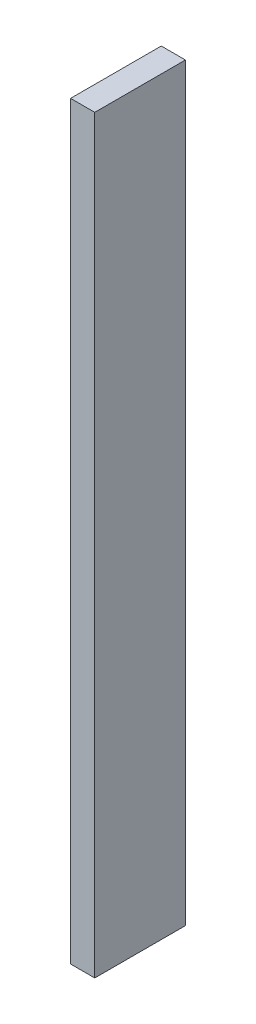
ISO-10303-21;
HEADER;
FILE_DESCRIPTION(('STEP AP214'),'2;1');
FILE_NAME('part.step','',(''),(''),'','','');
FILE_SCHEMA(('AUTOMOTIVE_DESIGN { 1 0 10303 214 1 1 1 1 }'));
ENDSEC;
DATA;
#1=APPLICATION_CONTEXT('core data for automotive mechanical design processes');
#2=APPLICATION_PROTOCOL_DEFINITION('international standard','automotive_design',2000,#1);
#3=PRODUCT_CONTEXT('',#1,'mechanical');
#4=PRODUCT('Part','Part','',(#3));
#5=PRODUCT_RELATED_PRODUCT_CATEGORY('part','',(#4));
#6=PRODUCT_DEFINITION_FORMATION('','',#4);
#7=PRODUCT_DEFINITION_CONTEXT('part definition',#1,'design');
#8=PRODUCT_DEFINITION('design','',#6,#7);
#9=PRODUCT_DEFINITION_SHAPE('','',#8);
#10=(LENGTH_UNIT() NAMED_UNIT(*) SI_UNIT(.MILLI.,.METRE.));
#11=(NAMED_UNIT(*) PLANE_ANGLE_UNIT() SI_UNIT($,.RADIAN.));
#12=(NAMED_UNIT(*) SI_UNIT($,.STERADIAN.) SOLID_ANGLE_UNIT());
#13=UNCERTAINTY_MEASURE_WITH_UNIT(LENGTH_MEASURE(1.E-05),#10,'distance_accuracy_value','');
#14=(GEOMETRIC_REPRESENTATION_CONTEXT(3) GLOBAL_UNCERTAINTY_ASSIGNED_CONTEXT((#13)) GLOBAL_UNIT_ASSIGNED_CONTEXT((#10,
#11,#12)) REPRESENTATION_CONTEXT('',''));
#15=CARTESIAN_POINT('',(0.,0.,0.));
#16=DIRECTION('',(0.,0.,1.));
#17=DIRECTION('',(1.,0.,0.));
#18=AXIS2_PLACEMENT_3D('',#15,#16,#17);
#19=CARTESIAN_POINT('',(-1.62196645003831E-13,62.,15.));
#20=DIRECTION('',(1.,0.,0.));
#21=DIRECTION('',(0.,0.,-1.));
#22=AXIS2_PLACEMENT_3D('',#19,#20,#21);
#23=PLANE('',#22);
#24=DIRECTION('',(0.,-1.,0.));
#25=VECTOR('',#24,1.);
#26=CARTESIAN_POINT('',(-1.62196645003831E-13,62.,15.));
#27=LINE('',#26,#25);
#28=CARTESIAN_POINT('',(2.70400021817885E-13,-62.,15.));
#29=VERTEX_POINT('',#28);
#30=CARTESIAN_POINT('',(-1.62630325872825E-13,62.,15.));
#31=VERTEX_POINT('',#30);
#32=EDGE_CURVE('E87',#29,#31,#27,.F.);
#33=ORIENTED_EDGE('',*,*,#32,.T.);
#34=DIRECTION('',(0.,0.,-1.));
#35=VECTOR('',#34,1.);
#36=CARTESIAN_POINT('',(-2.16189913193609E-13,62.,0.));
#37=LINE('',#36,#35);
#38=CARTESIAN_POINT('',(-2.1671523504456E-13,62.,0.));
#39=VERTEX_POINT('',#38);
#40=EDGE_CURVE('E10',#31,#39,#37,.T.);
#41=ORIENTED_EDGE('',*,*,#40,.T.);
#42=DIRECTION('',(0.,1.,0.));
#43=VECTOR('',#42,1.);
#44=CARTESIAN_POINT('',(2.17215991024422E-13,-62.2828427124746,0.));
#45=LINE('',#44,#43);
#46=CARTESIAN_POINT('',(-1.67834496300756E-13,48.,0.));
#47=VERTEX_POINT('',#46);
#48=EDGE_CURVE('E108',#47,#39,#45,.T.);
#49=ORIENTED_EDGE('',*,*,#48,.F.);
#50=DIRECTION('',(0.,0.,-1.));
#51=VECTOR('',#50,1.);
#52=CARTESIAN_POINT('',(-1.13190706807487E-13,48.,15.));
#53=LINE('',#52,#51);
#54=CARTESIAN_POINT('',(-1.46150452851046E-13,48.,6.));
#55=VERTEX_POINT('',#54);
#56=EDGE_CURVE('E112',#55,#47,#53,.T.);
#57=ORIENTED_EDGE('',*,*,#56,.F.);
#58=DIRECTION('',(0.,1.,0.));
#59=VECTOR('',#58,1.);
#60=CARTESIAN_POINT('',(-1.94505869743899E-13,62.,6.));
#61=LINE('',#60,#59);
#62=CARTESIAN_POINT('',(1.89301699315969E-13,-48.,6.));
#63=VERTEX_POINT('',#62);
#64=EDGE_CURVE('E114',#63,#55,#61,.T.);
#65=ORIENTED_EDGE('',*,*,#64,.F.);
#66=DIRECTION('',(0.,0.,-1.));
#67=VECTOR('',#66,1.);
#68=CARTESIAN_POINT('',(2.22044604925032E-13,-48.,15.));
#69=LINE('',#68,#67);
#70=CARTESIAN_POINT('',(1.67400815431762E-13,-48.,0.));
#71=VERTEX_POINT('',#70);
#72=EDGE_CURVE('E117',#71,#63,#69,.F.);
#73=ORIENTED_EDGE('',*,*,#72,.F.);
#74=CARTESIAN_POINT('',(-2.16715234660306E-13,-62.,0.));
#75=VERTEX_POINT('',#74);
#76=EDGE_CURVE('E109',#75,#71,#45,.T.);
#77=ORIENTED_EDGE('',*,*,#76,.F.);
#78=DIRECTION('',(0.,0.,-1.));
#79=VECTOR('',#78,1.);
#80=CARTESIAN_POINT('',(2.16840434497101E-13,-62.,0.));
#81=LINE('',#80,#79);
#82=EDGE_CURVE('E83',#29,#75,#81,.T.);
#83=ORIENTED_EDGE('',*,*,#82,.F.);
#84=EDGE_LOOP('',(#33,#41,#49,#57,#65,#73,#77,#83));
#85=FACE_BOUND('',#84,.T.);
#86=ADVANCED_FACE('F16',(#85),#23,.F.);
#87=CARTESIAN_POINT('',(3.89999999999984,62.,15.));
#88=DIRECTION('',(0.,0.,-1.));
#89=DIRECTION('',(-1.,0.,0.));
#90=AXIS2_PLACEMENT_3D('',#87,#88,#89);
#91=PLANE('',#90);
#92=DIRECTION('',(-1.,0.,0.));
#93=VECTOR('',#92,1.);
#94=CARTESIAN_POINT('',(3.90000000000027,-62.,15.));
#95=LINE('',#94,#93);
#96=CARTESIAN_POINT('',(4.00000000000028,-62.,15.));
#97=VERTEX_POINT('',#96);
#98=EDGE_CURVE('E38',#97,#29,#95,.T.);
#99=ORIENTED_EDGE('',*,*,#98,.F.);
#100=DIRECTION('',(0.,-1.,0.));
#101=VECTOR('',#100,1.);
#102=CARTESIAN_POINT('',(3.99999999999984,62.,15.));
#103=LINE('',#102,#101);
#104=CARTESIAN_POINT('',(3.99999999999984,62.,15.));
#105=VERTEX_POINT('',#104);
#106=EDGE_CURVE('E103',#105,#97,#103,.T.);
#107=ORIENTED_EDGE('',*,*,#106,.F.);
#108=DIRECTION('',(-1.,0.,0.));
#109=VECTOR('',#108,1.);
#110=CARTESIAN_POINT('',(3.89999999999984,62.,15.));
#111=LINE('',#110,#109);
#112=EDGE_CURVE('E24',#105,#31,#111,.T.);
#113=ORIENTED_EDGE('',*,*,#112,.T.);
#114=ORIENTED_EDGE('',*,*,#32,.F.);
#115=EDGE_LOOP('',(#99,#107,#113,#114));
#116=FACE_BOUND('',#115,.T.);
#117=ADVANCED_FACE('F18',(#116),#91,.F.);
#118=CARTESIAN_POINT('',(3.89999999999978,62.,0.));
#119=DIRECTION('',(0.,1.,0.));
#120=DIRECTION('',(-1.,0.,0.));
#121=AXIS2_PLACEMENT_3D('',#118,#119,#120);
#122=PLANE('',#121);
#123=DIRECTION('',(1.,0.,0.));
#124=VECTOR('',#123,1.);
#125=CARTESIAN_POINT('',(3.89999999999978,62.,0.));
#126=LINE('',#125,#124);
#127=CARTESIAN_POINT('',(3.99999999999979,62.,0.));
#128=VERTEX_POINT('',#127);
#129=EDGE_CURVE('E95',#39,#128,#126,.T.);
#130=ORIENTED_EDGE('',*,*,#129,.F.);
#131=ORIENTED_EDGE('',*,*,#40,.F.);
#132=ORIENTED_EDGE('',*,*,#112,.F.);
#133=DIRECTION('',(0.,0.,1.));
#134=VECTOR('',#133,1.);
#135=CARTESIAN_POINT('',(3.99999999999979,62.,0.));
#136=LINE('',#135,#134);
#137=EDGE_CURVE('E99',#128,#105,#136,.T.);
#138=ORIENTED_EDGE('',*,*,#137,.F.);
#139=EDGE_LOOP('',(#130,#131,#132,#138));
#140=FACE_BOUND('',#139,.T.);
#141=ADVANCED_FACE('F146',(#140),#122,.T.);
#142=CARTESIAN_POINT('',(3.90000000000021,-62.,0.));
#143=DIRECTION('',(0.,1.,0.));
#144=DIRECTION('',(-1.,0.,0.));
#145=AXIS2_PLACEMENT_3D('',#142,#143,#144);
#146=PLANE('',#145);
#147=ORIENTED_EDGE('',*,*,#82,.T.);
#148=DIRECTION('',(1.,0.,0.));
#149=VECTOR('',#148,1.);
#150=CARTESIAN_POINT('',(3.90000000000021,-62.,0.));
#151=LINE('',#150,#149);
#152=CARTESIAN_POINT('',(4.00000000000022,-62.,0.));
#153=VERTEX_POINT('',#152);
#154=EDGE_CURVE('E78',#75,#153,#151,.T.);
#155=ORIENTED_EDGE('',*,*,#154,.T.);
#156=DIRECTION('',(0.,0.,-1.));
#157=VECTOR('',#156,1.);
#158=CARTESIAN_POINT('',(4.00000000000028,-62.,15.));
#159=LINE('',#158,#157);
#160=EDGE_CURVE('E82',#97,#153,#159,.T.);
#161=ORIENTED_EDGE('',*,*,#160,.F.);
#162=ORIENTED_EDGE('',*,*,#98,.T.);
#163=EDGE_LOOP('',(#147,#155,#161,#162));
#164=FACE_BOUND('',#163,.T.);
#165=ADVANCED_FACE('F80',(#164),#146,.F.);
#166=CARTESIAN_POINT('',(-6.,0.,7.5));
#167=DIRECTION('',(-1.,0.,0.));
#168=DIRECTION('',(0.,0.,1.));
#169=AXIS2_PLACEMENT_3D('',#166,#167,#168);
#170=PLANE('',#169);
#171=DIRECTION('',(0.,0.,1.));
#172=VECTOR('',#171,1.);
#173=CARTESIAN_POINT('',(-5.99999999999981,-48.,6.));
#174=LINE('',#173,#172);
#175=CARTESIAN_POINT('',(-5.99999999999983,-48.,0.));
#176=VERTEX_POINT('',#175);
#177=CARTESIAN_POINT('',(-5.99999999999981,-48.,6.));
#178=VERTEX_POINT('',#177);
#179=EDGE_CURVE('E134',#176,#178,#174,.T.);
#180=ORIENTED_EDGE('',*,*,#179,.T.);
#181=DIRECTION('',(0.,1.,0.));
#182=VECTOR('',#181,1.);
#183=CARTESIAN_POINT('',(-6.00000000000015,48.,6.));
#184=LINE('',#183,#182);
#185=CARTESIAN_POINT('',(-6.00000000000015,48.,6.));
#186=VERTEX_POINT('',#185);
#187=EDGE_CURVE('E129',#178,#186,#184,.T.);
#188=ORIENTED_EDGE('',*,*,#187,.T.);
#189=DIRECTION('',(0.,0.,-1.));
#190=VECTOR('',#189,1.);
#191=CARTESIAN_POINT('',(-6.00000000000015,48.,6.));
#192=LINE('',#191,#190);
#193=CARTESIAN_POINT('',(-6.00000000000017,48.,0.));
#194=VERTEX_POINT('',#193);
#195=EDGE_CURVE('E123',#186,#194,#192,.T.);
#196=ORIENTED_EDGE('',*,*,#195,.T.);
#197=DIRECTION('',(0.,1.,0.));
#198=VECTOR('',#197,1.);
#199=CARTESIAN_POINT('',(-6.00000000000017,48.,0.));
#200=LINE('',#199,#198);
#201=EDGE_CURVE('E111',#194,#176,#200,.F.);
#202=ORIENTED_EDGE('',*,*,#201,.T.);
#203=EDGE_LOOP('',(#180,#188,#196,#202));
#204=FACE_BOUND('',#203,.T.);
#205=ADVANCED_FACE('F161',(#204),#170,.T.);
#206=CARTESIAN_POINT('',(-6.00000000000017,48.,0.));
#207=DIRECTION('',(0.,0.,1.));
#208=DIRECTION('',(1.,0.,0.));
#209=AXIS2_PLACEMENT_3D('',#206,#207,#208);
#210=PLANE('',#209);
#211=DIRECTION('',(-1.,0.,0.));
#212=VECTOR('',#211,1.);
#213=CARTESIAN_POINT('',(-5.99999999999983,-48.,0.));
#214=LINE('',#213,#212);
#215=EDGE_CURVE('E136',#71,#176,#214,.T.);
#216=ORIENTED_EDGE('',*,*,#215,.T.);
#217=ORIENTED_EDGE('',*,*,#201,.F.);
#218=DIRECTION('',(1.,0.,0.));
#219=VECTOR('',#218,1.);
#220=CARTESIAN_POINT('',(-6.00000000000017,48.,0.));
#221=LINE('',#220,#219);
#222=EDGE_CURVE('E120',#194,#47,#221,.T.);
#223=ORIENTED_EDGE('',*,*,#222,.T.);
#224=ORIENTED_EDGE('',*,*,#48,.T.);
#225=ORIENTED_EDGE('',*,*,#129,.T.);
#226=DIRECTION('',(0.,1.,0.));
#227=VECTOR('',#226,1.);
#228=CARTESIAN_POINT('',(4.00000000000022,-62.,0.));
#229=LINE('',#228,#227);
#230=EDGE_CURVE('E90',#153,#128,#229,.T.);
#231=ORIENTED_EDGE('',*,*,#230,.F.);
#232=ORIENTED_EDGE('',*,*,#154,.F.);
#233=ORIENTED_EDGE('',*,*,#76,.T.);
#234=EDGE_LOOP('',(#216,#217,#223,#224,#225,#231,#232,#233));
#235=FACE_BOUND('',#234,.T.);
#236=ADVANCED_FACE('F92',(#235),#210,.F.);
#237=CARTESIAN_POINT('',(-5.99999999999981,-48.,6.));
#238=DIRECTION('',(0.,1.,0.));
#239=DIRECTION('',(-1.,0.,0.));
#240=AXIS2_PLACEMENT_3D('',#237,#238,#239);
#241=PLANE('',#240);
#242=ORIENTED_EDGE('',*,*,#72,.T.);
#243=DIRECTION('',(-1.,0.,0.));
#244=VECTOR('',#243,1.);
#245=CARTESIAN_POINT('',(-5.99999999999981,-48.,6.));
#246=LINE('',#245,#244);
#247=EDGE_CURVE('E131',#63,#178,#246,.T.);
#248=ORIENTED_EDGE('',*,*,#247,.T.);
#249=ORIENTED_EDGE('',*,*,#179,.F.);
#250=ORIENTED_EDGE('',*,*,#215,.F.);
#251=EDGE_LOOP('',(#242,#248,#249,#250));
#252=FACE_BOUND('',#251,.T.);
#253=ADVANCED_FACE('F168',(#252),#241,.F.);
#254=CARTESIAN_POINT('',(-6.00000000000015,48.,6.));
#255=DIRECTION('',(0.,0.,-1.));
#256=DIRECTION('',(-1.,0.,0.));
#257=AXIS2_PLACEMENT_3D('',#254,#255,#256);
#258=PLANE('',#257);
#259=DIRECTION('',(1.,0.,0.));
#260=VECTOR('',#259,1.);
#261=CARTESIAN_POINT('',(-6.00000000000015,48.,6.));
#262=LINE('',#261,#260);
#263=EDGE_CURVE('E126',#55,#186,#262,.F.);
#264=ORIENTED_EDGE('',*,*,#263,.T.);
#265=ORIENTED_EDGE('',*,*,#187,.F.);
#266=ORIENTED_EDGE('',*,*,#247,.F.);
#267=ORIENTED_EDGE('',*,*,#64,.T.);
#268=EDGE_LOOP('',(#264,#265,#266,#267));
#269=FACE_BOUND('',#268,.T.);
#270=ADVANCED_FACE('F171',(#269),#258,.F.);
#271=CARTESIAN_POINT('',(-6.00000000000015,48.,6.));
#272=DIRECTION('',(0.,-1.,0.));
#273=DIRECTION('',(0.,0.,-1.));
#274=AXIS2_PLACEMENT_3D('',#271,#272,#273);
#275=PLANE('',#274);
#276=ORIENTED_EDGE('',*,*,#56,.T.);
#277=ORIENTED_EDGE('',*,*,#222,.F.);
#278=ORIENTED_EDGE('',*,*,#195,.F.);
#279=ORIENTED_EDGE('',*,*,#263,.F.);
#280=EDGE_LOOP('',(#276,#277,#278,#279));
#281=FACE_BOUND('',#280,.T.);
#282=ADVANCED_FACE('F162',(#281),#275,.F.);
#283=CARTESIAN_POINT('',(4.,0.,0.));
#284=DIRECTION('',(1.,0.,0.));
#285=DIRECTION('',(0.,0.,-1.));
#286=AXIS2_PLACEMENT_3D('',#283,#284,#285);
#287=PLANE('',#286);
#288=ORIENTED_EDGE('',*,*,#160,.T.);
#289=ORIENTED_EDGE('',*,*,#230,.T.);
#290=ORIENTED_EDGE('',*,*,#137,.T.);
#291=ORIENTED_EDGE('',*,*,#106,.T.);
#292=EDGE_LOOP('',(#288,#289,#290,#291));
#293=FACE_BOUND('',#292,.T.);
#294=ADVANCED_FACE('F102',(#293),#287,.T.);
#295=CLOSED_SHELL('',(#86,#117,#141,#165,#205,#236,#253,#270,#282,#294));
#296=MANIFOLD_SOLID_BREP('B1',#295);
#297=ADVANCED_BREP_SHAPE_REPRESENTATION('',(#18,#296),#14);
#298=SHAPE_DEFINITION_REPRESENTATION(#9,#297);
ENDSEC;
END-ISO-10303-21;
